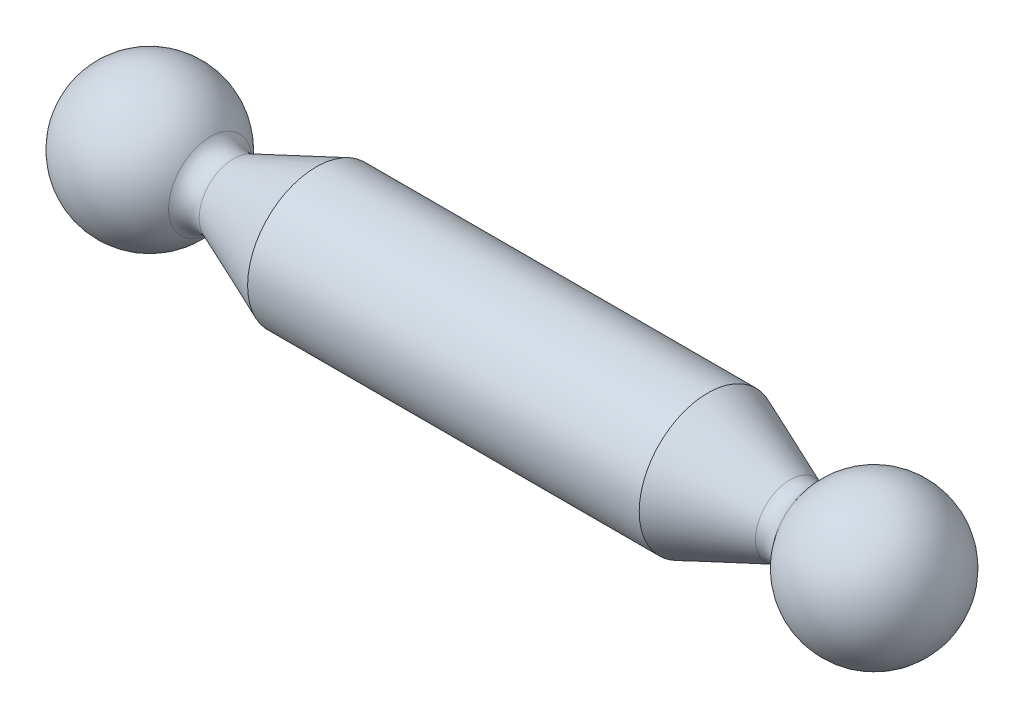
ISO-10303-21;
HEADER;
FILE_DESCRIPTION(('STEP AP214'),'2;1');
FILE_NAME('part.step','',(''),(''),'','','');
FILE_SCHEMA(('AUTOMOTIVE_DESIGN { 1 0 10303 214 1 1 1 1 }'));
ENDSEC;
DATA;
#1=APPLICATION_CONTEXT('core data for automotive mechanical design processes');
#2=APPLICATION_PROTOCOL_DEFINITION('international standard','automotive_design',2000,#1);
#3=PRODUCT_CONTEXT('',#1,'mechanical');
#4=PRODUCT('Part','Part','',(#3));
#5=PRODUCT_RELATED_PRODUCT_CATEGORY('part','',(#4));
#6=PRODUCT_DEFINITION_FORMATION('','',#4);
#7=PRODUCT_DEFINITION_CONTEXT('part definition',#1,'design');
#8=PRODUCT_DEFINITION('design','',#6,#7);
#9=PRODUCT_DEFINITION_SHAPE('','',#8);
#10=(LENGTH_UNIT() NAMED_UNIT(*) SI_UNIT(.MILLI.,.METRE.));
#11=(NAMED_UNIT(*) PLANE_ANGLE_UNIT() SI_UNIT($,.RADIAN.));
#12=(NAMED_UNIT(*) SI_UNIT($,.STERADIAN.) SOLID_ANGLE_UNIT());
#13=UNCERTAINTY_MEASURE_WITH_UNIT(LENGTH_MEASURE(1.E-05),#10,'distance_accuracy_value','');
#14=(GEOMETRIC_REPRESENTATION_CONTEXT(3) GLOBAL_UNCERTAINTY_ASSIGNED_CONTEXT((#13)) GLOBAL_UNIT_ASSIGNED_CONTEXT((#10,
#11,#12)) REPRESENTATION_CONTEXT('',''));
#15=CARTESIAN_POINT('',(0.,0.,0.));
#16=DIRECTION('',(0.,0.,1.));
#17=DIRECTION('',(1.,0.,0.));
#18=AXIS2_PLACEMENT_3D('',#15,#16,#17);
#19=CARTESIAN_POINT('',(0.,0.,0.));
#20=DIRECTION('',(-1.,0.,0.));
#21=DIRECTION('',(0.,0.,-1.));
#22=AXIS2_PLACEMENT_3D('',#19,#20,#21);
#23=SPHERICAL_SURFACE('',#22,7.5);
#24=CARTESIAN_POINT('',(6.17847401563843,0.,0.));
#25=DIRECTION('',(-1.,0.,0.));
#26=DIRECTION('',(0.,0.,1.));
#27=AXIS2_PLACEMENT_3D('',#24,#25,#26);
#28=CIRCLE('',#27,4.25164189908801);
#29=CARTESIAN_POINT('',(6.17847401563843,0.,4.25164189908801));
#30=VERTEX_POINT('',#29);
#31=EDGE_CURVE('E50',#30,#30,#28,.T.);
#32=ORIENTED_EDGE('',*,*,#31,.T.);
#33=EDGE_LOOP('',(#32));
#34=FACE_BOUND('',#33,.T.);
#35=ADVANCED_FACE('F28',(#34),#23,.T.);
#36=CARTESIAN_POINT('',(74.,0.,0.));
#37=DIRECTION('',(-1.,0.,0.));
#38=DIRECTION('',(0.,0.,-1.));
#39=AXIS2_PLACEMENT_3D('',#36,#37,#38);
#40=SPHERICAL_SURFACE('',#39,7.49999999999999);
#41=CARTESIAN_POINT('',(67.8215259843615,0.,0.));
#42=DIRECTION('',(-1.,0.,0.));
#43=DIRECTION('',(0.,0.,1.));
#44=AXIS2_PLACEMENT_3D('',#41,#42,#43);
#45=CIRCLE('',#44,4.25164189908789);
#46=CARTESIAN_POINT('',(67.8215259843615,0.,4.25164189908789));
#47=VERTEX_POINT('',#46);
#48=EDGE_CURVE('E10',#47,#47,#45,.T.);
#49=ORIENTED_EDGE('',*,*,#48,.F.);
#50=EDGE_LOOP('',(#49));
#51=FACE_BOUND('',#50,.T.);
#52=ADVANCED_FACE('F80',(#51),#40,.T.);
#53=CARTESIAN_POINT('',(66.1739329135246,0.,0.));
#54=DIRECTION('',(-1.,0.,0.));
#55=DIRECTION('',(0.,0.,1.));
#56=AXIS2_PLACEMENT_3D('',#53,#54,#55);
#57=TOROIDAL_SURFACE('',#56,5.385413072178,2.00000000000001);
#58=CARTESIAN_POINT('',(65.4124333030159,0.,0.));
#59=DIRECTION('',(-1.,0.,0.));
#60=DIRECTION('',(0.,0.,1.));
#61=AXIS2_PLACEMENT_3D('',#58,#59,#60);
#62=CIRCLE('',#61,3.53605687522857);
#63=CARTESIAN_POINT('',(65.4124333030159,0.,3.53605687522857));
#64=VERTEX_POINT('',#63);
#65=EDGE_CURVE('E34',#64,#64,#62,.T.);
#66=ORIENTED_EDGE('',*,*,#65,.F.);
#67=EDGE_LOOP('',(#66));
#68=FACE_BOUND('',#67,.T.);
#69=ORIENTED_EDGE('',*,*,#48,.T.);
#70=EDGE_LOOP('',(#69));
#71=FACE_BOUND('',#70,.T.);
#72=ADVANCED_FACE('F75',(#68,#71),#57,.F.);
#73=CARTESIAN_POINT('',(65.4124333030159,0.,0.));
#74=DIRECTION('',(-1.,0.,0.));
#75=DIRECTION('',(0.,0.,1.));
#76=AXIS2_PLACEMENT_3D('',#73,#74,#75);
#77=CONICAL_SURFACE('',#76,3.53605687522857,0.3906070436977);
#78=CARTESIAN_POINT('',(57.,0.,0.));
#79=DIRECTION('',(-1.,0.,0.));
#80=DIRECTION('',(0.,0.,1.));
#81=AXIS2_PLACEMENT_3D('',#78,#79,#80);
#82=CIRCLE('',#81,6.99999999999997);
#83=CARTESIAN_POINT('',(57.,0.,6.99999999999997));
#84=VERTEX_POINT('',#83);
#85=EDGE_CURVE('E38',#84,#84,#82,.T.);
#86=ORIENTED_EDGE('',*,*,#85,.F.);
#87=EDGE_LOOP('',(#86));
#88=FACE_BOUND('',#87,.T.);
#89=ORIENTED_EDGE('',*,*,#65,.T.);
#90=EDGE_LOOP('',(#89));
#91=FACE_BOUND('',#90,.T.);
#92=ADVANCED_FACE('F70',(#88,#91),#77,.T.);
#93=CARTESIAN_POINT('',(-7.5,0.,0.));
#94=DIRECTION('',(-1.,0.,0.));
#95=DIRECTION('',(0.,0.,1.));
#96=AXIS2_PLACEMENT_3D('',#93,#94,#95);
#97=CYLINDRICAL_SURFACE('',#96,6.99999999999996);
#98=CARTESIAN_POINT('',(17.,0.,0.));
#99=DIRECTION('',(-1.,0.,0.));
#100=DIRECTION('',(0.,0.,1.));
#101=AXIS2_PLACEMENT_3D('',#98,#99,#100);
#102=CIRCLE('',#101,6.99999999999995);
#103=CARTESIAN_POINT('',(17.,0.,6.99999999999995));
#104=VERTEX_POINT('',#103);
#105=EDGE_CURVE('E42',#104,#104,#102,.T.);
#106=ORIENTED_EDGE('',*,*,#105,.F.);
#107=EDGE_LOOP('',(#106));
#108=FACE_BOUND('',#107,.T.);
#109=ORIENTED_EDGE('',*,*,#85,.T.);
#110=EDGE_LOOP('',(#109));
#111=FACE_BOUND('',#110,.T.);
#112=ADVANCED_FACE('F64',(#108,#111),#97,.T.);
#113=CARTESIAN_POINT('',(17.,0.,0.));
#114=DIRECTION('',(1.,0.,0.));
#115=DIRECTION('',(0.,0.,-1.));
#116=AXIS2_PLACEMENT_3D('',#113,#114,#115);
#117=CONICAL_SURFACE('',#116,6.99999999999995,0.390607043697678);
#118=CARTESIAN_POINT('',(8.58756669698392,0.,0.));
#119=DIRECTION('',(-1.,0.,0.));
#120=DIRECTION('',(0.,0.,1.));
#121=AXIS2_PLACEMENT_3D('',#118,#119,#120);
#122=CIRCLE('',#121,3.53605687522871);
#123=CARTESIAN_POINT('',(8.58756669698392,0.,3.53605687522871));
#124=VERTEX_POINT('',#123);
#125=EDGE_CURVE('E47',#124,#124,#122,.T.);
#126=ORIENTED_EDGE('',*,*,#125,.F.);
#127=EDGE_LOOP('',(#126));
#128=FACE_BOUND('',#127,.T.);
#129=ORIENTED_EDGE('',*,*,#105,.T.);
#130=EDGE_LOOP('',(#129));
#131=FACE_BOUND('',#130,.T.);
#132=ADVANCED_FACE('F58',(#128,#131),#117,.T.);
#133=CARTESIAN_POINT('',(7.82606708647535,0.,0.));
#134=DIRECTION('',(-1.,0.,0.));
#135=DIRECTION('',(0.,0.,1.));
#136=AXIS2_PLACEMENT_3D('',#133,#134,#135);
#137=TOROIDAL_SURFACE('',#136,5.38541307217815,2.);
#138=ORIENTED_EDGE('',*,*,#31,.F.);
#139=EDGE_LOOP('',(#138));
#140=FACE_BOUND('',#139,.T.);
#141=ORIENTED_EDGE('',*,*,#125,.T.);
#142=EDGE_LOOP('',(#141));
#143=FACE_BOUND('',#142,.T.);
#144=ADVANCED_FACE('F55',(#140,#143),#137,.F.);
#145=CLOSED_SHELL('',(#35,#52,#72,#92,#112,#132,#144));
#146=MANIFOLD_SOLID_BREP('B2',#145);
#147=ADVANCED_BREP_SHAPE_REPRESENTATION('',(#18,#146),#14);
#148=SHAPE_DEFINITION_REPRESENTATION(#9,#147);
ENDSEC;
END-ISO-10303-21;
